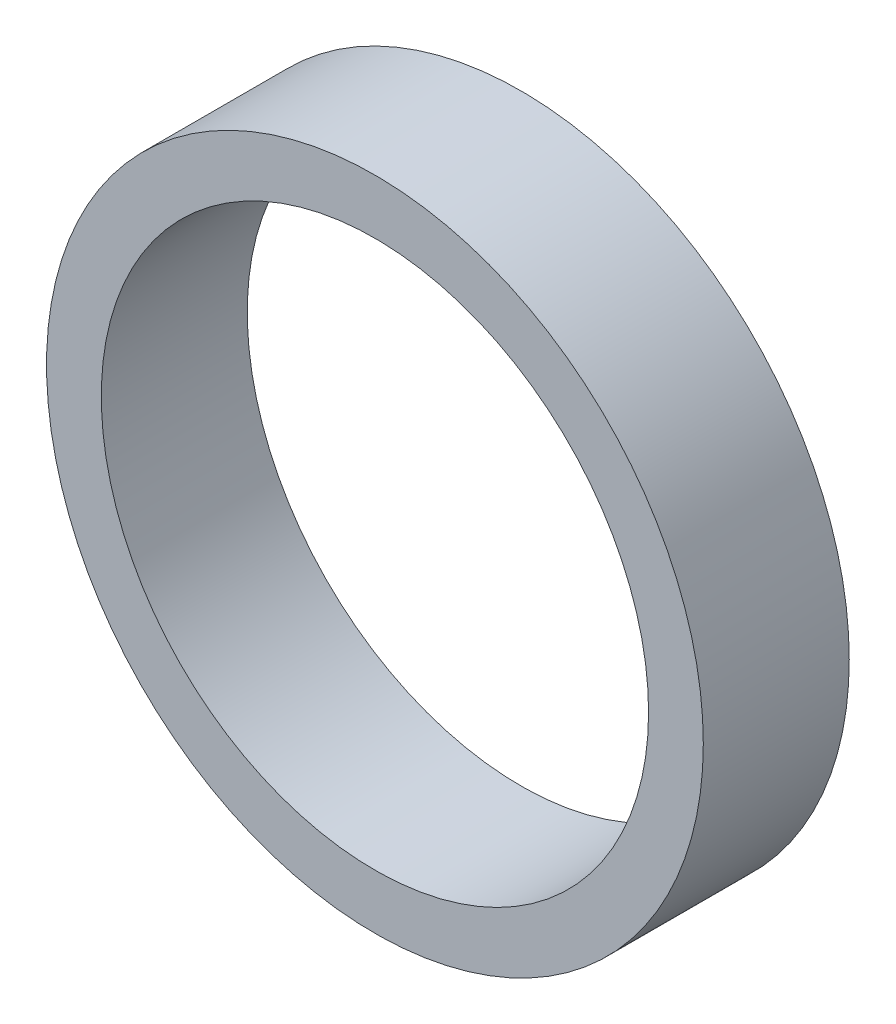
ISO-10303-21;
HEADER;
FILE_DESCRIPTION(('STEP AP214'),'2;1');
FILE_NAME('part.step','',(''),(''),'','','');
FILE_SCHEMA(('AUTOMOTIVE_DESIGN { 1 0 10303 214 1 1 1 1 }'));
ENDSEC;
DATA;
#1=APPLICATION_CONTEXT('core data for automotive mechanical design processes');
#2=APPLICATION_PROTOCOL_DEFINITION('international standard','automotive_design',2000,#1);
#3=PRODUCT_CONTEXT('',#1,'mechanical');
#4=PRODUCT('Part','Part','',(#3));
#5=PRODUCT_RELATED_PRODUCT_CATEGORY('part','',(#4));
#6=PRODUCT_DEFINITION_FORMATION('','',#4);
#7=PRODUCT_DEFINITION_CONTEXT('part definition',#1,'design');
#8=PRODUCT_DEFINITION('design','',#6,#7);
#9=PRODUCT_DEFINITION_SHAPE('','',#8);
#10=(LENGTH_UNIT() NAMED_UNIT(*) SI_UNIT(.MILLI.,.METRE.));
#11=(NAMED_UNIT(*) PLANE_ANGLE_UNIT() SI_UNIT($,.RADIAN.));
#12=(NAMED_UNIT(*) SI_UNIT($,.STERADIAN.) SOLID_ANGLE_UNIT());
#13=UNCERTAINTY_MEASURE_WITH_UNIT(LENGTH_MEASURE(1.E-05),#10,'distance_accuracy_value','');
#14=(GEOMETRIC_REPRESENTATION_CONTEXT(3) GLOBAL_UNCERTAINTY_ASSIGNED_CONTEXT((#13)) GLOBAL_UNIT_ASSIGNED_CONTEXT((#10,
#11,#12)) REPRESENTATION_CONTEXT('',''));
#15=CARTESIAN_POINT('',(0.,0.,0.));
#16=DIRECTION('',(0.,0.,1.));
#17=DIRECTION('',(1.,0.,0.));
#18=AXIS2_PLACEMENT_3D('',#15,#16,#17);
#19=CARTESIAN_POINT('',(0.,0.,8.));
#20=DIRECTION('',(0.,0.,1.));
#21=DIRECTION('',(1.,0.,0.));
#22=AXIS2_PLACEMENT_3D('',#19,#20,#21);
#23=PLANE('',#22);
#24=CARTESIAN_POINT('',(0.,0.,8.));
#25=DIRECTION('',(0.,0.,1.));
#26=DIRECTION('',(1.,0.,0.));
#27=AXIS2_PLACEMENT_3D('',#24,#25,#26);
#28=CIRCLE('',#27,18.);
#29=CARTESIAN_POINT('',(18.,0.,8.));
#30=VERTEX_POINT('',#29);
#31=EDGE_CURVE('E10',#30,#30,#28,.T.);
#32=ORIENTED_EDGE('',*,*,#31,.T.);
#33=EDGE_LOOP('',(#32));
#34=FACE_BOUND('',#33,.T.);
#35=CARTESIAN_POINT('',(0.,0.,8.));
#36=DIRECTION('',(0.,0.,1.));
#37=DIRECTION('',(1.,0.,0.));
#38=AXIS2_PLACEMENT_3D('',#35,#36,#37);
#39=CIRCLE('',#38,15.);
#40=CARTESIAN_POINT('',(15.,0.,8.));
#41=VERTEX_POINT('',#40);
#42=EDGE_CURVE('E52',#41,#41,#39,.T.);
#43=ORIENTED_EDGE('',*,*,#42,.F.);
#44=EDGE_LOOP('',(#43));
#45=FACE_BOUND('',#44,.T.);
#46=ADVANCED_FACE('F41',(#34,#45),#23,.T.);
#47=CARTESIAN_POINT('',(0.,0.,0.));
#48=DIRECTION('',(0.,0.,1.));
#49=DIRECTION('',(1.,0.,0.));
#50=AXIS2_PLACEMENT_3D('',#47,#48,#49);
#51=PLANE('',#50);
#52=CARTESIAN_POINT('',(0.,0.,0.));
#53=DIRECTION('',(0.,0.,1.));
#54=DIRECTION('',(1.,0.,0.));
#55=AXIS2_PLACEMENT_3D('',#52,#53,#54);
#56=CIRCLE('',#55,18.);
#57=CARTESIAN_POINT('',(18.,0.,0.));
#58=VERTEX_POINT('',#57);
#59=EDGE_CURVE('E45',#58,#58,#56,.T.);
#60=ORIENTED_EDGE('',*,*,#59,.F.);
#61=EDGE_LOOP('',(#60));
#62=FACE_BOUND('',#61,.T.);
#63=CARTESIAN_POINT('',(0.,0.,0.));
#64=DIRECTION('',(0.,0.,1.));
#65=DIRECTION('',(1.,0.,0.));
#66=AXIS2_PLACEMENT_3D('',#63,#64,#65);
#67=CIRCLE('',#66,15.);
#68=CARTESIAN_POINT('',(15.,0.,0.));
#69=VERTEX_POINT('',#68);
#70=EDGE_CURVE('E54',#69,#69,#67,.T.);
#71=ORIENTED_EDGE('',*,*,#70,.T.);
#72=EDGE_LOOP('',(#71));
#73=FACE_BOUND('',#72,.T.);
#74=ADVANCED_FACE('F64',(#62,#73),#51,.F.);
#75=CARTESIAN_POINT('',(0.,0.,8.));
#76=DIRECTION('',(0.,0.,-1.));
#77=DIRECTION('',(-1.,0.,0.));
#78=AXIS2_PLACEMENT_3D('',#75,#76,#77);
#79=CYLINDRICAL_SURFACE('',#78,18.);
#80=ORIENTED_EDGE('',*,*,#31,.F.);
#81=EDGE_LOOP('',(#80));
#82=FACE_BOUND('',#81,.T.);
#83=ORIENTED_EDGE('',*,*,#59,.T.);
#84=EDGE_LOOP('',(#83));
#85=FACE_BOUND('',#84,.T.);
#86=ADVANCED_FACE('F43',(#82,#85),#79,.T.);
#87=CARTESIAN_POINT('',(0.,0.,8.));
#88=DIRECTION('',(0.,0.,-1.));
#89=DIRECTION('',(-1.,0.,0.));
#90=AXIS2_PLACEMENT_3D('',#87,#88,#89);
#91=CYLINDRICAL_SURFACE('',#90,15.);
#92=ORIENTED_EDGE('',*,*,#42,.T.);
#93=EDGE_LOOP('',(#92));
#94=FACE_BOUND('',#93,.T.);
#95=ORIENTED_EDGE('',*,*,#70,.F.);
#96=EDGE_LOOP('',(#95));
#97=FACE_BOUND('',#96,.T.);
#98=ADVANCED_FACE('F60',(#94,#97),#91,.F.);
#99=CLOSED_SHELL('',(#46,#74,#86,#98));
#100=MANIFOLD_SOLID_BREP('B2',#99);
#101=ADVANCED_BREP_SHAPE_REPRESENTATION('',(#18,#100),#14);
#102=SHAPE_DEFINITION_REPRESENTATION(#9,#101);
ENDSEC;
END-ISO-10303-21;
